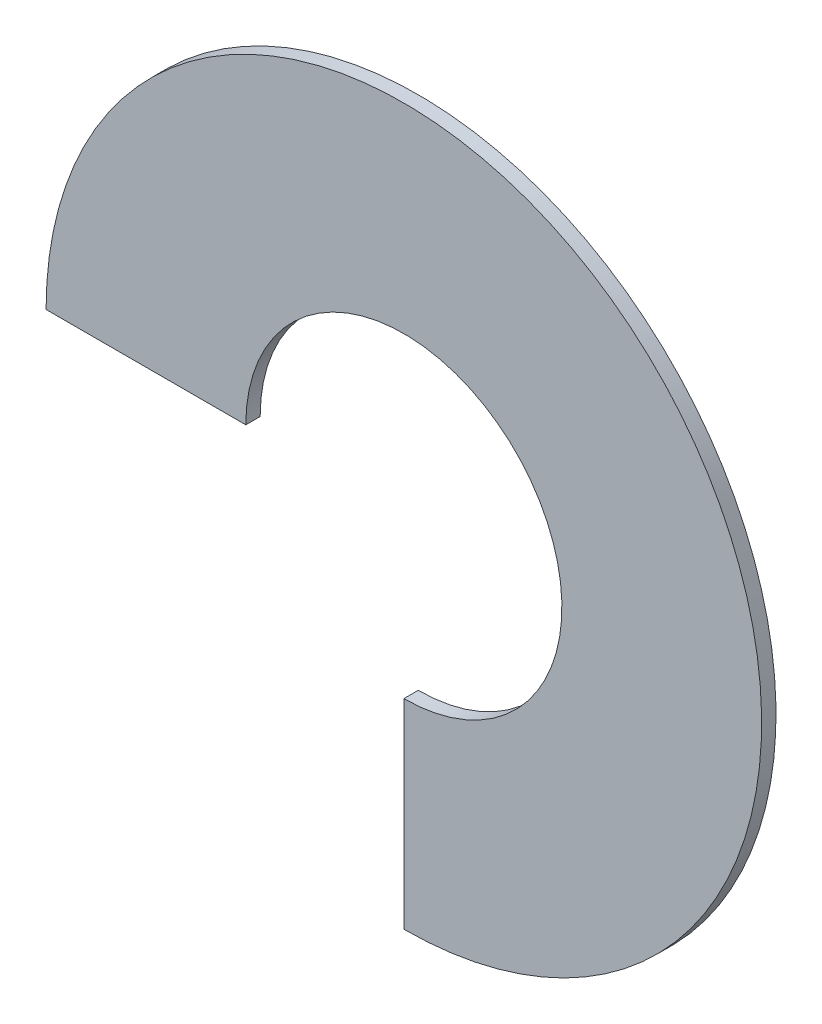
ISO-10303-21;
HEADER;
FILE_DESCRIPTION(('STEP AP214'),'2;1');
FILE_NAME('part.step','',(''),(''),'','','');
FILE_SCHEMA(('AUTOMOTIVE_DESIGN { 1 0 10303 214 1 1 1 1 }'));
ENDSEC;
DATA;
#1=APPLICATION_CONTEXT('core data for automotive mechanical design processes');
#2=APPLICATION_PROTOCOL_DEFINITION('international standard','automotive_design',2000,#1);
#3=PRODUCT_CONTEXT('',#1,'mechanical');
#4=PRODUCT('Part','Part','',(#3));
#5=PRODUCT_RELATED_PRODUCT_CATEGORY('part','',(#4));
#6=PRODUCT_DEFINITION_FORMATION('','',#4);
#7=PRODUCT_DEFINITION_CONTEXT('part definition',#1,'design');
#8=PRODUCT_DEFINITION('design','',#6,#7);
#9=PRODUCT_DEFINITION_SHAPE('','',#8);
#10=(LENGTH_UNIT() NAMED_UNIT(*) SI_UNIT(.MILLI.,.METRE.));
#11=(NAMED_UNIT(*) PLANE_ANGLE_UNIT() SI_UNIT($,.RADIAN.));
#12=(NAMED_UNIT(*) SI_UNIT($,.STERADIAN.) SOLID_ANGLE_UNIT());
#13=UNCERTAINTY_MEASURE_WITH_UNIT(LENGTH_MEASURE(1.E-05),#10,'distance_accuracy_value','');
#14=(GEOMETRIC_REPRESENTATION_CONTEXT(3) GLOBAL_UNCERTAINTY_ASSIGNED_CONTEXT((#13)) GLOBAL_UNIT_ASSIGNED_CONTEXT((#10,
#11,#12)) REPRESENTATION_CONTEXT('',''));
#15=CARTESIAN_POINT('',(0.,0.,0.));
#16=DIRECTION('',(0.,0.,1.));
#17=DIRECTION('',(1.,0.,0.));
#18=AXIS2_PLACEMENT_3D('',#15,#16,#17);
#19=CARTESIAN_POINT('',(0.,0.,0.5));
#20=DIRECTION('',(0.,0.,-1.));
#21=DIRECTION('',(-1.,0.,0.));
#22=AXIS2_PLACEMENT_3D('',#19,#20,#21);
#23=CYLINDRICAL_SURFACE('',#22,12.45);
#24=DIRECTION('',(0.,0.,1.));
#25=VECTOR('',#24,1.);
#26=CARTESIAN_POINT('',(-12.45,0.,9.36975308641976));
#27=LINE('',#26,#25);
#28=CARTESIAN_POINT('',(-12.45,0.,0.));
#29=VERTEX_POINT('',#28);
#30=CARTESIAN_POINT('',(-12.45,0.,0.5));
#31=VERTEX_POINT('',#30);
#32=EDGE_CURVE('E82',#29,#31,#27,.T.);
#33=ORIENTED_EDGE('',*,*,#32,.T.);
#34=CARTESIAN_POINT('',(0.,0.,0.5));
#35=DIRECTION('',(0.,0.,1.));
#36=DIRECTION('',(1.,0.,0.));
#37=AXIS2_PLACEMENT_3D('',#34,#35,#36);
#38=CIRCLE('',#37,12.45);
#39=CARTESIAN_POINT('',(0.,-12.45,0.5));
#40=VERTEX_POINT('',#39);
#41=EDGE_CURVE('E74',#40,#31,#38,.T.);
#42=ORIENTED_EDGE('',*,*,#41,.F.);
#43=DIRECTION('',(0.,0.,-1.));
#44=VECTOR('',#43,1.);
#45=CARTESIAN_POINT('',(0.,-12.45,0.5));
#46=LINE('',#45,#44);
#47=CARTESIAN_POINT('',(0.,-12.45,0.));
#48=VERTEX_POINT('',#47);
#49=EDGE_CURVE('E100',#40,#48,#46,.T.);
#50=ORIENTED_EDGE('',*,*,#49,.T.);
#51=CARTESIAN_POINT('',(0.,0.,0.));
#52=DIRECTION('',(0.,0.,1.));
#53=DIRECTION('',(1.,0.,0.));
#54=AXIS2_PLACEMENT_3D('',#51,#52,#53);
#55=CIRCLE('',#54,12.45);
#56=EDGE_CURVE('E81',#48,#29,#55,.T.);
#57=ORIENTED_EDGE('',*,*,#56,.T.);
#58=EDGE_LOOP('',(#33,#42,#50,#57));
#59=FACE_BOUND('',#58,.T.);
#60=ADVANCED_FACE('F30',(#59),#23,.T.);
#61=CARTESIAN_POINT('',(0.,0.,0.5));
#62=DIRECTION('',(0.,0.,1.));
#63=DIRECTION('',(1.,0.,0.));
#64=AXIS2_PLACEMENT_3D('',#61,#62,#63);
#65=PLANE('',#64);
#66=DIRECTION('',(-1.,0.,0.));
#67=VECTOR('',#66,1.);
#68=CARTESIAN_POINT('',(0.,0.,0.5));
#69=LINE('',#68,#67);
#70=CARTESIAN_POINT('',(-5.5,0.,0.5));
#71=VERTEX_POINT('',#70);
#72=EDGE_CURVE('E86',#71,#31,#69,.T.);
#73=ORIENTED_EDGE('',*,*,#72,.F.);
#74=CARTESIAN_POINT('',(0.,0.,0.5));
#75=DIRECTION('',(0.,0.,1.));
#76=DIRECTION('',(1.,0.,0.));
#77=AXIS2_PLACEMENT_3D('',#74,#75,#76);
#78=CIRCLE('',#77,5.5);
#79=CARTESIAN_POINT('',(0.,-5.5,0.5));
#80=VERTEX_POINT('',#79);
#81=EDGE_CURVE('E85',#80,#71,#78,.T.);
#82=ORIENTED_EDGE('',*,*,#81,.F.);
#83=DIRECTION('',(0.,1.,0.));
#84=VECTOR('',#83,1.);
#85=CARTESIAN_POINT('',(0.,0.,0.5));
#86=LINE('',#85,#84);
#87=EDGE_CURVE('E51',#40,#80,#86,.T.);
#88=ORIENTED_EDGE('',*,*,#87,.F.);
#89=ORIENTED_EDGE('',*,*,#41,.T.);
#90=EDGE_LOOP('',(#73,#82,#88,#89));
#91=FACE_BOUND('',#90,.T.);
#92=ADVANCED_FACE('F97',(#91),#65,.T.);
#93=CARTESIAN_POINT('',(0.,0.,0.));
#94=DIRECTION('',(0.,0.,1.));
#95=DIRECTION('',(1.,0.,0.));
#96=AXIS2_PLACEMENT_3D('',#93,#94,#95);
#97=PLANE('',#96);
#98=CARTESIAN_POINT('',(0.,0.,0.));
#99=DIRECTION('',(0.,0.,1.));
#100=DIRECTION('',(1.,0.,0.));
#101=AXIS2_PLACEMENT_3D('',#98,#99,#100);
#102=CIRCLE('',#101,5.5);
#103=CARTESIAN_POINT('',(0.,-5.5,0.));
#104=VERTEX_POINT('',#103);
#105=CARTESIAN_POINT('',(-5.5,0.,0.));
#106=VERTEX_POINT('',#105);
#107=EDGE_CURVE('E79',#104,#106,#102,.T.);
#108=ORIENTED_EDGE('',*,*,#107,.T.);
#109=DIRECTION('',(-1.,0.,0.));
#110=VECTOR('',#109,1.);
#111=CARTESIAN_POINT('',(0.,0.,0.));
#112=LINE('',#111,#110);
#113=EDGE_CURVE('E43',#106,#29,#112,.T.);
#114=ORIENTED_EDGE('',*,*,#113,.T.);
#115=ORIENTED_EDGE('',*,*,#56,.F.);
#116=DIRECTION('',(0.,1.,0.));
#117=VECTOR('',#116,1.);
#118=CARTESIAN_POINT('',(0.,0.,0.));
#119=LINE('',#118,#117);
#120=EDGE_CURVE('E68',#48,#104,#119,.T.);
#121=ORIENTED_EDGE('',*,*,#120,.T.);
#122=EDGE_LOOP('',(#108,#114,#115,#121));
#123=FACE_BOUND('',#122,.T.);
#124=ADVANCED_FACE('F78',(#123),#97,.F.);
#125=CARTESIAN_POINT('',(0.,0.,0.5));
#126=DIRECTION('',(0.,0.,-1.));
#127=DIRECTION('',(-1.,0.,0.));
#128=AXIS2_PLACEMENT_3D('',#125,#126,#127);
#129=CYLINDRICAL_SURFACE('',#128,5.5);
#130=DIRECTION('',(0.,0.,-1.));
#131=VECTOR('',#130,1.);
#132=CARTESIAN_POINT('',(-5.5,0.,0.5));
#133=LINE('',#132,#131);
#134=EDGE_CURVE('E11',#106,#71,#133,.F.);
#135=ORIENTED_EDGE('',*,*,#134,.F.);
#136=ORIENTED_EDGE('',*,*,#107,.F.);
#137=DIRECTION('',(0.,0.,-1.));
#138=VECTOR('',#137,1.);
#139=CARTESIAN_POINT('',(0.,-5.5,0.5));
#140=LINE('',#139,#138);
#141=EDGE_CURVE('E37',#80,#104,#140,.T.);
#142=ORIENTED_EDGE('',*,*,#141,.F.);
#143=ORIENTED_EDGE('',*,*,#81,.T.);
#144=EDGE_LOOP('',(#135,#136,#142,#143));
#145=FACE_BOUND('',#144,.T.);
#146=ADVANCED_FACE('F84',(#145),#129,.F.);
#147=CARTESIAN_POINT('',(0.,-21.3189732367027,9.36975308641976));
#148=DIRECTION('',(1.,0.,0.));
#149=DIRECTION('',(0.,0.,-1.));
#150=AXIS2_PLACEMENT_3D('',#147,#148,#149);
#151=PLANE('',#150);
#152=ORIENTED_EDGE('',*,*,#87,.T.);
#153=ORIENTED_EDGE('',*,*,#141,.T.);
#154=ORIENTED_EDGE('',*,*,#120,.F.);
#155=ORIENTED_EDGE('',*,*,#49,.F.);
#156=EDGE_LOOP('',(#152,#153,#154,#155));
#157=FACE_BOUND('',#156,.T.);
#158=ADVANCED_FACE('F67',(#157),#151,.F.);
#159=CARTESIAN_POINT('',(-12.45,0.,9.36975308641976));
#160=DIRECTION('',(0.,1.,0.));
#161=DIRECTION('',(0.,0.,1.));
#162=AXIS2_PLACEMENT_3D('',#159,#160,#161);
#163=PLANE('',#162);
#164=ORIENTED_EDGE('',*,*,#72,.T.);
#165=ORIENTED_EDGE('',*,*,#32,.F.);
#166=ORIENTED_EDGE('',*,*,#113,.F.);
#167=ORIENTED_EDGE('',*,*,#134,.T.);
#168=EDGE_LOOP('',(#164,#165,#166,#167));
#169=FACE_BOUND('',#168,.T.);
#170=ADVANCED_FACE('F104',(#169),#163,.F.);
#171=CLOSED_SHELL('',(#60,#92,#124,#146,#158,#170));
#172=MANIFOLD_SOLID_BREP('B2',#171);
#173=ADVANCED_BREP_SHAPE_REPRESENTATION('',(#18,#172),#14);
#174=SHAPE_DEFINITION_REPRESENTATION(#9,#173);
ENDSEC;
END-ISO-10303-21;
